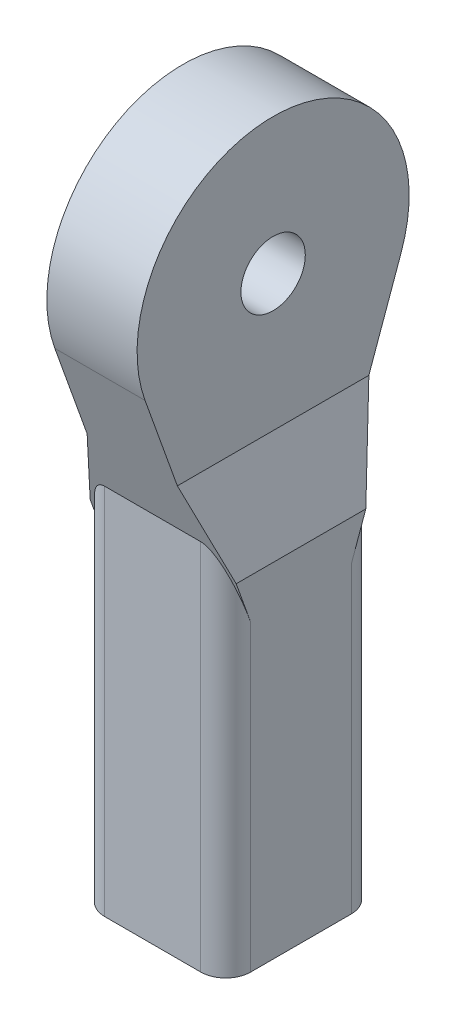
ISO-10303-21;
HEADER;
FILE_DESCRIPTION(('STEP AP214'),'2;1');
FILE_NAME('part.step','',(''),(''),'','','');
FILE_SCHEMA(('AUTOMOTIVE_DESIGN { 1 0 10303 214 1 1 1 1 }'));
ENDSEC;
DATA;
#1=APPLICATION_CONTEXT('core data for automotive mechanical design processes');
#2=APPLICATION_PROTOCOL_DEFINITION('international standard','automotive_design',2000,#1);
#3=PRODUCT_CONTEXT('',#1,'mechanical');
#4=PRODUCT('Part','Part','',(#3));
#5=PRODUCT_RELATED_PRODUCT_CATEGORY('part','',(#4));
#6=PRODUCT_DEFINITION_FORMATION('','',#4);
#7=PRODUCT_DEFINITION_CONTEXT('part definition',#1,'design');
#8=PRODUCT_DEFINITION('design','',#6,#7);
#9=PRODUCT_DEFINITION_SHAPE('','',#8);
#10=(LENGTH_UNIT() NAMED_UNIT(*) SI_UNIT(.MILLI.,.METRE.));
#11=(NAMED_UNIT(*) PLANE_ANGLE_UNIT() SI_UNIT($,.RADIAN.));
#12=(NAMED_UNIT(*) SI_UNIT($,.STERADIAN.) SOLID_ANGLE_UNIT());
#13=UNCERTAINTY_MEASURE_WITH_UNIT(LENGTH_MEASURE(1.E-05),#10,'distance_accuracy_value','');
#14=(GEOMETRIC_REPRESENTATION_CONTEXT(3) GLOBAL_UNCERTAINTY_ASSIGNED_CONTEXT((#13)) GLOBAL_UNIT_ASSIGNED_CONTEXT((#10,
#11,#12)) REPRESENTATION_CONTEXT('',''));
#15=CARTESIAN_POINT('',(0.,0.,0.));
#16=DIRECTION('',(0.,0.,1.));
#17=DIRECTION('',(1.,0.,0.));
#18=AXIS2_PLACEMENT_3D('',#15,#16,#17);
#19=CARTESIAN_POINT('',(4.0894,9.56309999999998,-0.867800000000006));
#20=DIRECTION('',(-1.,0.,0.));
#21=DIRECTION('',(0.,0.,1.));
#22=AXIS2_PLACEMENT_3D('',#19,#20,#21);
#23=CYLINDRICAL_SURFACE('',#22,3.81);
#24=DIRECTION('',(-1.,0.,0.));
#25=VECTOR('',#24,1.);
#26=CARTESIAN_POINT('',(4.0894,8.27758924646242,2.7187808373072));
#27=LINE('',#26,#25);
#28=CARTESIAN_POINT('',(3.30835,8.27758924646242,2.7187808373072));
#29=VERTEX_POINT('',#28);
#30=CARTESIAN_POINT('',(0.781049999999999,8.27758924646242,2.7187808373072));
#31=VERTEX_POINT('',#30);
#32=EDGE_CURVE('E200',#29,#31,#27,.T.);
#33=ORIENTED_EDGE('',*,*,#32,.F.);
#34=CARTESIAN_POINT('',(3.30835,9.56309999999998,-0.867800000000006));
#35=DIRECTION('',(-1.,0.,0.));
#36=DIRECTION('',(0.,-1.,0.));
#37=AXIS2_PLACEMENT_3D('',#34,#35,#36);
#38=CIRCLE('',#37,3.81);
#39=CARTESIAN_POINT('',(3.30835,8.27758924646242,-4.45438083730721));
#40=VERTEX_POINT('',#39);
#41=EDGE_CURVE('E287',#29,#40,#38,.T.);
#42=ORIENTED_EDGE('',*,*,#41,.T.);
#43=DIRECTION('',(-1.,0.,0.));
#44=VECTOR('',#43,1.);
#45=CARTESIAN_POINT('',(4.0894,8.27758924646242,-4.45438083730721));
#46=LINE('',#45,#44);
#47=CARTESIAN_POINT('',(0.781049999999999,8.27758924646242,-4.45438083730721));
#48=VERTEX_POINT('',#47);
#49=EDGE_CURVE('E203',#40,#48,#46,.T.);
#50=ORIENTED_EDGE('',*,*,#49,.T.);
#51=CARTESIAN_POINT('',(0.781049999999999,9.56309999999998,-0.867800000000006));
#52=DIRECTION('',(1.,0.,0.));
#53=DIRECTION('',(0.,1.,0.));
#54=AXIS2_PLACEMENT_3D('',#51,#52,#53);
#55=CIRCLE('',#54,3.81);
#56=EDGE_CURVE('E295',#48,#31,#55,.T.);
#57=ORIENTED_EDGE('',*,*,#56,.T.);
#58=EDGE_LOOP('',(#33,#42,#50,#57));
#59=FACE_BOUND('',#58,.T.);
#60=ADVANCED_FACE('F44',(#59),#23,.T.);
#61=CARTESIAN_POINT('',(4.0894,-6.28650000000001,-2.97600000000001));
#62=DIRECTION('',(0.,0.,1.));
#63=DIRECTION('',(1.,0.,0.));
#64=AXIS2_PLACEMENT_3D('',#61,#62,#63);
#65=PLANE('',#64);
#66=DIRECTION('',(-1.,0.,0.));
#67=VECTOR('',#66,1.);
#68=CARTESIAN_POINT('',(4.0894,-6.28650000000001,-2.97600000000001));
#69=LINE('',#68,#67);
#70=CARTESIAN_POINT('',(3.3894,-6.28650000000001,-2.97600000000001));
#71=VERTEX_POINT('',#70);
#72=CARTESIAN_POINT('',(0.7,-6.28650000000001,-2.97600000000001));
#73=VERTEX_POINT('',#72);
#74=EDGE_CURVE('E187',#71,#73,#69,.T.);
#75=ORIENTED_EDGE('',*,*,#74,.T.);
#76=DIRECTION('',(0.,1.,0.));
#77=VECTOR('',#76,1.);
#78=CARTESIAN_POINT('',(0.7,-6.28650000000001,-2.97600000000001));
#79=LINE('',#78,#77);
#80=CARTESIAN_POINT('',(0.7,4.15289999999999,-2.97600000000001));
#81=VERTEX_POINT('',#80);
#82=EDGE_CURVE('E238',#73,#81,#79,.T.);
#83=ORIENTED_EDGE('',*,*,#82,.T.);
#84=DIRECTION('',(-1.,0.,0.));
#85=VECTOR('',#84,1.);
#86=CARTESIAN_POINT('',(4.0894,4.15289999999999,-2.97600000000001));
#87=LINE('',#86,#85);
#88=CARTESIAN_POINT('',(3.3894,4.15289999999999,-2.97600000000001));
#89=VERTEX_POINT('',#88);
#90=EDGE_CURVE('E207',#89,#81,#87,.T.);
#91=ORIENTED_EDGE('',*,*,#90,.F.);
#92=DIRECTION('',(0.,1.,0.));
#93=VECTOR('',#92,1.);
#94=CARTESIAN_POINT('',(3.3894,-6.28650000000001,-2.97600000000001));
#95=LINE('',#94,#93);
#96=EDGE_CURVE('E235',#89,#71,#95,.F.);
#97=ORIENTED_EDGE('',*,*,#96,.T.);
#98=EDGE_LOOP('',(#75,#83,#91,#97));
#99=FACE_BOUND('',#98,.T.);
#100=ADVANCED_FACE('F334',(#99),#65,.F.);
#101=CARTESIAN_POINT('',(4.0894,4.15289999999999,-2.97600000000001));
#102=DIRECTION('',(0.,0.337404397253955,0.941359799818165));
#103=DIRECTION('',(0.,-0.941359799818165,0.337404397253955));
#104=AXIS2_PLACEMENT_3D('',#101,#102,#103);
#105=PLANE('',#104);
#106=DIRECTION('',(0.,-0.941359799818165,0.337404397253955));
#107=VECTOR('',#106,1.);
#108=CARTESIAN_POINT('',(3.30835,4.15289999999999,-2.97600000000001));
#109=LINE('',#108,#107);
#110=CARTESIAN_POINT('',(3.30835,5.75309999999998,-3.54954745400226));
#111=VERTEX_POINT('',#110);
#112=EDGE_CURVE('E280',#40,#111,#109,.T.);
#113=ORIENTED_EDGE('',*,*,#112,.T.);
#114=DIRECTION('',(0.291038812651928,-0.9006095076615,0.32279858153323));
#115=VECTOR('',#114,1.);
#116=CARTESIAN_POINT('',(3.8478228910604,4.08371985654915,-2.95120428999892));
#117=LINE('',#116,#115);
#118=CARTESIAN_POINT('',(4.0894,3.33616787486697,-2.68326494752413));
#119=VERTEX_POINT('',#118);
#120=EDGE_CURVE('E298',#111,#119,#117,.T.);
#121=ORIENTED_EDGE('',*,*,#120,.T.);
#122=DIRECTION('',(0.,0.941359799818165,-0.337404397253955));
#123=VECTOR('',#122,1.);
#124=CARTESIAN_POINT('',(4.0894,4.15289999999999,-2.97600000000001));
#125=LINE('',#124,#123);
#126=CARTESIAN_POINT('',(4.0894,2.19989682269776,-2.27600000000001));
#127=VERTEX_POINT('',#126);
#128=EDGE_CURVE('E181',#127,#119,#125,.T.);
#129=ORIENTED_EDGE('',*,*,#128,.F.);
#130=CARTESIAN_POINT('',(3.3894,2.19989682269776,-2.27600000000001));
#131=DIRECTION('',(0.,0.337404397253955,0.941359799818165));
#132=DIRECTION('',(0.,-0.941359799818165,0.337404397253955));
#133=AXIS2_PLACEMENT_3D('',#130,#131,#132);
#134=ELLIPSE('',#133,2.07466175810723,0.7);
#135=EDGE_CURVE('E257',#127,#89,#134,.T.);
#136=ORIENTED_EDGE('',*,*,#135,.T.);
#137=ORIENTED_EDGE('',*,*,#90,.T.);
#138=CARTESIAN_POINT('',(0.7,2.19989682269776,-2.27600000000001));
#139=DIRECTION('',(0.,0.337404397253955,0.941359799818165));
#140=DIRECTION('',(0.,0.941359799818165,-0.337404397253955));
#141=AXIS2_PLACEMENT_3D('',#138,#139,#140);
#142=ELLIPSE('',#141,2.07466175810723,0.7);
#143=CARTESIAN_POINT('',(0.,2.19989682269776,-2.27600000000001));
#144=VERTEX_POINT('',#143);
#145=EDGE_CURVE('E253',#81,#144,#142,.T.);
#146=ORIENTED_EDGE('',*,*,#145,.T.);
#147=DIRECTION('',(0.,0.941359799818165,-0.337404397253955));
#148=VECTOR('',#147,1.);
#149=CARTESIAN_POINT('',(0.,4.15289999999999,-2.97600000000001));
#150=LINE('',#149,#148);
#151=CARTESIAN_POINT('',(0.,3.33616787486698,-2.68326494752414));
#152=VERTEX_POINT('',#151);
#153=EDGE_CURVE('E176',#144,#152,#150,.T.);
#154=ORIENTED_EDGE('',*,*,#153,.T.);
#155=DIRECTION('',(0.291038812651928,0.9006095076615,-0.32279858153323));
#156=VECTOR('',#155,1.);
#157=CARTESIAN_POINT('',(0.587963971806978,5.15560198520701,-3.33539080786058));
#158=LINE('',#157,#156);
#159=CARTESIAN_POINT('',(0.781049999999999,5.75309999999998,-3.54954745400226));
#160=VERTEX_POINT('',#159);
#161=EDGE_CURVE('E69',#152,#160,#158,.T.);
#162=ORIENTED_EDGE('',*,*,#161,.T.);
#163=DIRECTION('',(0.,0.941359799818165,-0.337404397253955));
#164=VECTOR('',#163,1.);
#165=CARTESIAN_POINT('',(0.781049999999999,4.15289999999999,-2.97600000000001));
#166=LINE('',#165,#164);
#167=EDGE_CURVE('E291',#160,#48,#166,.T.);
#168=ORIENTED_EDGE('',*,*,#167,.T.);
#169=ORIENTED_EDGE('',*,*,#49,.F.);
#170=EDGE_LOOP('',(#113,#121,#129,#136,#137,#146,#154,#162,#168,#169));
#171=FACE_BOUND('',#170,.T.);
#172=ADVANCED_FACE('F342',(#171),#105,.F.);
#173=CARTESIAN_POINT('',(4.0894,4.15289999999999,1.2404));
#174=DIRECTION('',(0.,0.337404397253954,-0.941359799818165));
#175=DIRECTION('',(0.,0.941359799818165,0.337404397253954));
#176=AXIS2_PLACEMENT_3D('',#173,#174,#175);
#177=PLANE('',#176);
#178=DIRECTION('',(0.,-0.941359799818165,-0.337404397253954));
#179=VECTOR('',#178,1.);
#180=CARTESIAN_POINT('',(4.0894,4.15289999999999,1.2404));
#181=LINE('',#180,#179);
#182=CARTESIAN_POINT('',(4.0894,3.33616787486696,0.947664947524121));
#183=VERTEX_POINT('',#182);
#184=CARTESIAN_POINT('',(4.0894,2.19989682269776,0.540399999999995));
#185=VERTEX_POINT('',#184);
#186=EDGE_CURVE('E269',#183,#185,#181,.T.);
#187=ORIENTED_EDGE('',*,*,#186,.F.);
#188=DIRECTION('',(-0.291038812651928,0.9006095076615,0.32279858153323));
#189=VECTOR('',#188,1.);
#190=CARTESIAN_POINT('',(3.8478228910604,4.08371985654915,1.21560428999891));
#191=LINE('',#190,#189);
#192=CARTESIAN_POINT('',(3.30835,5.75309999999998,1.81394745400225));
#193=VERTEX_POINT('',#192);
#194=EDGE_CURVE('E61',#183,#193,#191,.T.);
#195=ORIENTED_EDGE('',*,*,#194,.T.);
#196=DIRECTION('',(0.,0.941359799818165,0.337404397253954));
#197=VECTOR('',#196,1.);
#198=CARTESIAN_POINT('',(3.30835,4.15289999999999,1.2404));
#199=LINE('',#198,#197);
#200=EDGE_CURVE('E11',#193,#29,#199,.T.);
#201=ORIENTED_EDGE('',*,*,#200,.T.);
#202=ORIENTED_EDGE('',*,*,#32,.T.);
#203=DIRECTION('',(0.,-0.941359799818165,-0.337404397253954));
#204=VECTOR('',#203,1.);
#205=CARTESIAN_POINT('',(0.781049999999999,4.15289999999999,1.24039999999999));
#206=LINE('',#205,#204);
#207=CARTESIAN_POINT('',(0.78105,5.75309999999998,1.81394745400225));
#208=VERTEX_POINT('',#207);
#209=EDGE_CURVE('E54',#31,#208,#206,.T.);
#210=ORIENTED_EDGE('',*,*,#209,.T.);
#211=DIRECTION('',(-0.291038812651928,-0.900609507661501,-0.32279858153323));
#212=VECTOR('',#211,1.);
#213=CARTESIAN_POINT('',(0.587963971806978,5.15560198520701,1.59979080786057));
#214=LINE('',#213,#212);
#215=CARTESIAN_POINT('',(0.,3.33616787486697,0.947664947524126));
#216=VERTEX_POINT('',#215);
#217=EDGE_CURVE('E149',#208,#216,#214,.T.);
#218=ORIENTED_EDGE('',*,*,#217,.T.);
#219=DIRECTION('',(0.,-0.941359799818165,-0.337404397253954));
#220=VECTOR('',#219,1.);
#221=CARTESIAN_POINT('',(0.,4.15289999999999,1.2404));
#222=LINE('',#221,#220);
#223=CARTESIAN_POINT('',(0.,2.19989682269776,0.540399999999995));
#224=VERTEX_POINT('',#223);
#225=EDGE_CURVE('E162',#216,#224,#222,.T.);
#226=ORIENTED_EDGE('',*,*,#225,.T.);
#227=CARTESIAN_POINT('',(0.7,2.19989682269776,0.540399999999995));
#228=DIRECTION('',(0.,0.337404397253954,-0.941359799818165));
#229=DIRECTION('',(0.,-0.941359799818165,-0.337404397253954));
#230=AXIS2_PLACEMENT_3D('',#227,#228,#229);
#231=ELLIPSE('',#230,2.07466175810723,0.7);
#232=CARTESIAN_POINT('',(0.7,4.15289999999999,1.2404));
#233=VERTEX_POINT('',#232);
#234=EDGE_CURVE('E250',#224,#233,#231,.T.);
#235=ORIENTED_EDGE('',*,*,#234,.T.);
#236=DIRECTION('',(-1.,0.,0.));
#237=VECTOR('',#236,1.);
#238=CARTESIAN_POINT('',(4.0894,4.15289999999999,1.2404));
#239=LINE('',#238,#237);
#240=CARTESIAN_POINT('',(3.3894,4.15289999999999,1.2404));
#241=VERTEX_POINT('',#240);
#242=EDGE_CURVE('E196',#241,#233,#239,.T.);
#243=ORIENTED_EDGE('',*,*,#242,.F.);
#244=CARTESIAN_POINT('',(3.3894,2.19989682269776,0.540399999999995));
#245=DIRECTION('',(0.,0.337404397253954,-0.941359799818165));
#246=DIRECTION('',(0.,0.941359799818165,0.337404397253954));
#247=AXIS2_PLACEMENT_3D('',#244,#245,#246);
#248=ELLIPSE('',#247,2.07466175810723,0.7);
#249=EDGE_CURVE('E156',#241,#185,#248,.T.);
#250=ORIENTED_EDGE('',*,*,#249,.T.);
#251=EDGE_LOOP('',(#187,#195,#201,#202,#210,#218,#226,#235,#243,#250));
#252=FACE_BOUND('',#251,.T.);
#253=ADVANCED_FACE('F161',(#252),#177,.F.);
#254=CARTESIAN_POINT('',(4.0894,-6.28650000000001,1.24039999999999));
#255=DIRECTION('',(0.,0.,-1.));
#256=DIRECTION('',(0.,1.,0.));
#257=AXIS2_PLACEMENT_3D('',#254,#255,#256);
#258=PLANE('',#257);
#259=ORIENTED_EDGE('',*,*,#242,.T.);
#260=DIRECTION('',(0.,-1.,0.));
#261=VECTOR('',#260,1.);
#262=CARTESIAN_POINT('',(0.7,-6.28650000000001,1.24039999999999));
#263=LINE('',#262,#261);
#264=CARTESIAN_POINT('',(0.7,-6.28650000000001,1.24039999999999));
#265=VERTEX_POINT('',#264);
#266=EDGE_CURVE('E214',#233,#265,#263,.T.);
#267=ORIENTED_EDGE('',*,*,#266,.T.);
#268=DIRECTION('',(-1.,0.,0.));
#269=VECTOR('',#268,1.);
#270=CARTESIAN_POINT('',(4.0894,-6.28650000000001,1.24039999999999));
#271=LINE('',#270,#269);
#272=CARTESIAN_POINT('',(3.3894,-6.28650000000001,1.24039999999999));
#273=VERTEX_POINT('',#272);
#274=EDGE_CURVE('E191',#273,#265,#271,.T.);
#275=ORIENTED_EDGE('',*,*,#274,.F.);
#276=DIRECTION('',(0.,-1.,0.));
#277=VECTOR('',#276,1.);
#278=CARTESIAN_POINT('',(3.3894,4.15289999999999,1.2404));
#279=LINE('',#278,#277);
#280=EDGE_CURVE('E211',#273,#241,#279,.F.);
#281=ORIENTED_EDGE('',*,*,#280,.T.);
#282=EDGE_LOOP('',(#259,#267,#275,#281));
#283=FACE_BOUND('',#282,.T.);
#284=ADVANCED_FACE('F380',(#283),#258,.F.);
#285=CARTESIAN_POINT('',(4.0894,-6.28650000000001,1.24039999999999));
#286=DIRECTION('',(0.,1.,0.));
#287=DIRECTION('',(0.,0.,1.));
#288=AXIS2_PLACEMENT_3D('',#285,#286,#287);
#289=PLANE('',#288);
#290=CARTESIAN_POINT('',(2.0447,-6.28650000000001,-0.867800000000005));
#291=DIRECTION('',(0.,-1.,0.));
#292=DIRECTION('',(0.,0.,-1.));
#293=AXIS2_PLACEMENT_3D('',#290,#291,#292);
#294=CIRCLE('',#293,0.900000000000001);
#295=CARTESIAN_POINT('',(2.0447,-6.28650000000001,-1.76780000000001));
#296=VERTEX_POINT('',#295);
#297=EDGE_CURVE('E276',#296,#296,#294,.T.);
#298=ORIENTED_EDGE('',*,*,#297,.F.);
#299=EDGE_LOOP('',(#298));
#300=FACE_BOUND('',#299,.T.);
#301=ORIENTED_EDGE('',*,*,#274,.T.);
#302=CARTESIAN_POINT('',(0.7,-6.28650000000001,0.540399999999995));
#303=DIRECTION('',(0.,1.,0.));
#304=DIRECTION('',(0.,0.,1.));
#305=AXIS2_PLACEMENT_3D('',#302,#303,#304);
#306=CIRCLE('',#305,0.7);
#307=CARTESIAN_POINT('',(0.,-6.28650000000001,0.540399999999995));
#308=VERTEX_POINT('',#307);
#309=EDGE_CURVE('E227',#265,#308,#306,.F.);
#310=ORIENTED_EDGE('',*,*,#309,.T.);
#311=DIRECTION('',(0.,0.,-1.));
#312=VECTOR('',#311,1.);
#313=CARTESIAN_POINT('',(0.,-6.28650000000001,1.24039999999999));
#314=LINE('',#313,#312);
#315=CARTESIAN_POINT('',(0.,-6.28650000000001,-2.27600000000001));
#316=VERTEX_POINT('',#315);
#317=EDGE_CURVE('E175',#308,#316,#314,.T.);
#318=ORIENTED_EDGE('',*,*,#317,.T.);
#319=CARTESIAN_POINT('',(0.7,-6.28650000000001,-2.27600000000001));
#320=DIRECTION('',(0.,1.,0.));
#321=DIRECTION('',(0.,0.,1.));
#322=AXIS2_PLACEMENT_3D('',#319,#320,#321);
#323=CIRCLE('',#322,0.7);
#324=EDGE_CURVE('E224',#316,#73,#323,.F.);
#325=ORIENTED_EDGE('',*,*,#324,.T.);
#326=ORIENTED_EDGE('',*,*,#74,.F.);
#327=CARTESIAN_POINT('',(3.3894,-6.28650000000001,-2.27600000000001));
#328=DIRECTION('',(0.,1.,0.));
#329=DIRECTION('',(0.,0.,1.));
#330=AXIS2_PLACEMENT_3D('',#327,#328,#329);
#331=CIRCLE('',#330,0.7);
#332=CARTESIAN_POINT('',(4.0894,-6.28650000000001,-2.27600000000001));
#333=VERTEX_POINT('',#332);
#334=EDGE_CURVE('E221',#71,#333,#331,.F.);
#335=ORIENTED_EDGE('',*,*,#334,.T.);
#336=DIRECTION('',(0.,0.,-1.));
#337=VECTOR('',#336,1.);
#338=CARTESIAN_POINT('',(4.0894,-6.28650000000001,1.24039999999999));
#339=LINE('',#338,#337);
#340=CARTESIAN_POINT('',(4.0894,-6.28650000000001,0.540399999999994));
#341=VERTEX_POINT('',#340);
#342=EDGE_CURVE('E192',#341,#333,#339,.T.);
#343=ORIENTED_EDGE('',*,*,#342,.F.);
#344=CARTESIAN_POINT('',(3.3894,-6.28650000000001,0.540399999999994));
#345=DIRECTION('',(0.,1.,0.));
#346=DIRECTION('',(0.,0.,1.));
#347=AXIS2_PLACEMENT_3D('',#344,#345,#346);
#348=CIRCLE('',#347,0.7);
#349=EDGE_CURVE('E218',#341,#273,#348,.F.);
#350=ORIENTED_EDGE('',*,*,#349,.T.);
#351=EDGE_LOOP('',(#301,#310,#318,#325,#326,#335,#343,#350));
#352=FACE_BOUND('',#351,.T.);
#353=ADVANCED_FACE('F373',(#300,#352),#289,.F.);
#354=CARTESIAN_POINT('',(4.0894,9.56309999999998,-0.867800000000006));
#355=DIRECTION('',(1.,0.,0.));
#356=DIRECTION('',(0.,0.,-1.));
#357=AXIS2_PLACEMENT_3D('',#354,#355,#356);
#358=PLANE('',#357);
#359=DIRECTION('',(0.,0.,-1.));
#360=VECTOR('',#359,1.);
#361=CARTESIAN_POINT('',(4.0894,3.33616787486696,-0.867800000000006));
#362=LINE('',#361,#360);
#363=EDGE_CURVE('E155',#183,#119,#362,.T.);
#364=ORIENTED_EDGE('',*,*,#363,.F.);
#365=ORIENTED_EDGE('',*,*,#186,.T.);
#366=DIRECTION('',(0.,-1.,0.));
#367=VECTOR('',#366,1.);
#368=CARTESIAN_POINT('',(4.0894,-6.28650000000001,0.540399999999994));
#369=LINE('',#368,#367);
#370=EDGE_CURVE('E242',#185,#341,#369,.T.);
#371=ORIENTED_EDGE('',*,*,#370,.T.);
#372=ORIENTED_EDGE('',*,*,#342,.T.);
#373=DIRECTION('',(0.,1.,0.));
#374=VECTOR('',#373,1.);
#375=CARTESIAN_POINT('',(4.0894,4.15289999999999,-2.27600000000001));
#376=LINE('',#375,#374);
#377=EDGE_CURVE('E246',#333,#127,#376,.T.);
#378=ORIENTED_EDGE('',*,*,#377,.T.);
#379=ORIENTED_EDGE('',*,*,#128,.T.);
#380=EDGE_LOOP('',(#364,#365,#371,#372,#378,#379));
#381=FACE_BOUND('',#380,.T.);
#382=ADVANCED_FACE('F374',(#381),#358,.T.);
#383=CARTESIAN_POINT('',(0.,9.56309999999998,-0.867800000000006));
#384=DIRECTION('',(1.,0.,0.));
#385=DIRECTION('',(0.,0.,-1.));
#386=AXIS2_PLACEMENT_3D('',#383,#384,#385);
#387=PLANE('',#386);
#388=ORIENTED_EDGE('',*,*,#225,.F.);
#389=DIRECTION('',(0.,0.,-1.));
#390=VECTOR('',#389,1.);
#391=CARTESIAN_POINT('',(0.,3.33616787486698,-0.867800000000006));
#392=LINE('',#391,#390);
#393=EDGE_CURVE('E146',#216,#152,#392,.T.);
#394=ORIENTED_EDGE('',*,*,#393,.T.);
#395=ORIENTED_EDGE('',*,*,#153,.F.);
#396=DIRECTION('',(0.,1.,0.));
#397=VECTOR('',#396,1.);
#398=CARTESIAN_POINT('',(0.,9.56309999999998,-2.27600000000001));
#399=LINE('',#398,#397);
#400=EDGE_CURVE('E230',#144,#316,#399,.F.);
#401=ORIENTED_EDGE('',*,*,#400,.T.);
#402=ORIENTED_EDGE('',*,*,#317,.F.);
#403=DIRECTION('',(0.,-1.,0.));
#404=VECTOR('',#403,1.);
#405=CARTESIAN_POINT('',(0.,9.56309999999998,0.540399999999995));
#406=LINE('',#405,#404);
#407=EDGE_CURVE('E172',#308,#224,#406,.F.);
#408=ORIENTED_EDGE('',*,*,#407,.T.);
#409=EDGE_LOOP('',(#388,#394,#395,#401,#402,#408));
#410=FACE_BOUND('',#409,.T.);
#411=ADVANCED_FACE('F169',(#410),#387,.F.);
#412=CARTESIAN_POINT('',(2.0447,-3.74650000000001,-0.867800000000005));
#413=DIRECTION('',(0.,-1.,0.));
#414=DIRECTION('',(0.,0.,-1.));
#415=AXIS2_PLACEMENT_3D('',#412,#413,#414);
#416=CYLINDRICAL_SURFACE('',#415,0.900000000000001);
#417=CARTESIAN_POINT('',(2.0447,-3.74650000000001,-0.867800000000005));
#418=DIRECTION('',(0.,-1.,0.));
#419=DIRECTION('',(0.,0.,-1.));
#420=AXIS2_PLACEMENT_3D('',#417,#418,#419);
#421=CIRCLE('',#420,0.900000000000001);
#422=CARTESIAN_POINT('',(2.0447,-3.74650000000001,-1.76780000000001));
#423=VERTEX_POINT('',#422);
#424=EDGE_CURVE('E183',#423,#423,#421,.T.);
#425=ORIENTED_EDGE('',*,*,#424,.F.);
#426=EDGE_LOOP('',(#425));
#427=FACE_BOUND('',#426,.T.);
#428=ORIENTED_EDGE('',*,*,#297,.T.);
#429=EDGE_LOOP('',(#428));
#430=FACE_BOUND('',#429,.T.);
#431=ADVANCED_FACE('F400',(#427,#430),#416,.F.);
#432=CARTESIAN_POINT('',(2.0447,-3.74650000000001,-0.867800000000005));
#433=DIRECTION('',(0.,-1.,0.));
#434=DIRECTION('',(0.,0.,-1.));
#435=AXIS2_PLACEMENT_3D('',#432,#433,#434);
#436=PLANE('',#435);
#437=ORIENTED_EDGE('',*,*,#424,.T.);
#438=EDGE_LOOP('',(#437));
#439=FACE_BOUND('',#438,.T.);
#440=ADVANCED_FACE('F355',(#439),#436,.T.);
#441=CARTESIAN_POINT('',(0.7,-6.28650000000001,0.540399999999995));
#442=DIRECTION('',(0.,-1.,0.));
#443=DIRECTION('',(0.,0.,-1.));
#444=AXIS2_PLACEMENT_3D('',#441,#442,#443);
#445=CYLINDRICAL_SURFACE('',#444,0.7);
#446=ORIENTED_EDGE('',*,*,#234,.F.);
#447=ORIENTED_EDGE('',*,*,#407,.F.);
#448=ORIENTED_EDGE('',*,*,#309,.F.);
#449=ORIENTED_EDGE('',*,*,#266,.F.);
#450=EDGE_LOOP('',(#446,#447,#448,#449));
#451=FACE_BOUND('',#450,.T.);
#452=ADVANCED_FACE('F351',(#451),#445,.T.);
#453=CARTESIAN_POINT('',(0.7,-6.28650000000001,-2.27600000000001));
#454=DIRECTION('',(0.,1.,0.));
#455=DIRECTION('',(0.,0.,1.));
#456=AXIS2_PLACEMENT_3D('',#453,#454,#455);
#457=CYLINDRICAL_SURFACE('',#456,0.7);
#458=ORIENTED_EDGE('',*,*,#324,.F.);
#459=ORIENTED_EDGE('',*,*,#400,.F.);
#460=ORIENTED_EDGE('',*,*,#145,.F.);
#461=ORIENTED_EDGE('',*,*,#82,.F.);
#462=EDGE_LOOP('',(#458,#459,#460,#461));
#463=FACE_BOUND('',#462,.T.);
#464=ADVANCED_FACE('F354',(#463),#457,.T.);
#465=CARTESIAN_POINT('',(3.3894,9.56309999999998,-2.27600000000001));
#466=DIRECTION('',(0.,-1.,0.));
#467=DIRECTION('',(0.,0.,-1.));
#468=AXIS2_PLACEMENT_3D('',#465,#466,#467);
#469=CYLINDRICAL_SURFACE('',#468,0.7);
#470=ORIENTED_EDGE('',*,*,#334,.F.);
#471=ORIENTED_EDGE('',*,*,#96,.F.);
#472=ORIENTED_EDGE('',*,*,#135,.F.);
#473=ORIENTED_EDGE('',*,*,#377,.F.);
#474=EDGE_LOOP('',(#470,#471,#472,#473));
#475=FACE_BOUND('',#474,.T.);
#476=ADVANCED_FACE('F358',(#475),#469,.T.);
#477=CARTESIAN_POINT('',(3.3894,9.56309999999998,0.540399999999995));
#478=DIRECTION('',(0.,1.,0.));
#479=DIRECTION('',(0.,0.,1.));
#480=AXIS2_PLACEMENT_3D('',#477,#478,#479);
#481=CYLINDRICAL_SURFACE('',#480,0.7);
#482=ORIENTED_EDGE('',*,*,#249,.F.);
#483=ORIENTED_EDGE('',*,*,#280,.F.);
#484=ORIENTED_EDGE('',*,*,#349,.F.);
#485=ORIENTED_EDGE('',*,*,#370,.F.);
#486=EDGE_LOOP('',(#482,#483,#484,#485));
#487=FACE_BOUND('',#486,.T.);
#488=ADVANCED_FACE('F46',(#487),#481,.T.);
#489=CARTESIAN_POINT('',(0.781049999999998,13.3731,-4.6778));
#490=DIRECTION('',(1.,0.,0.));
#491=DIRECTION('',(0.,1.,0.));
#492=AXIS2_PLACEMENT_3D('',#489,#490,#491);
#493=PLANE('',#492);
#494=CARTESIAN_POINT('',(0.781049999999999,9.56309999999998,-0.867800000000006));
#495=DIRECTION('',(1.,0.,0.));
#496=DIRECTION('',(0.,1.,0.));
#497=AXIS2_PLACEMENT_3D('',#494,#495,#496);
#498=CIRCLE('',#497,0.9017);
#499=CARTESIAN_POINT('',(0.781049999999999,10.4648,-0.867800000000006));
#500=VERTEX_POINT('',#499);
#501=EDGE_CURVE('E309',#500,#500,#498,.T.);
#502=ORIENTED_EDGE('',*,*,#501,.T.);
#503=EDGE_LOOP('',(#502));
#504=FACE_BOUND('',#503,.T.);
#505=DIRECTION('',(0.,0.,1.));
#506=VECTOR('',#505,1.);
#507=CARTESIAN_POINT('',(0.781049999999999,5.75309999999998,-4.6778));
#508=LINE('',#507,#506);
#509=EDGE_CURVE('E306',#160,#208,#508,.T.);
#510=ORIENTED_EDGE('',*,*,#509,.T.);
#511=ORIENTED_EDGE('',*,*,#209,.F.);
#512=ORIENTED_EDGE('',*,*,#56,.F.);
#513=ORIENTED_EDGE('',*,*,#167,.F.);
#514=EDGE_LOOP('',(#510,#511,#512,#513));
#515=FACE_BOUND('',#514,.T.);
#516=ADVANCED_FACE('F364',(#504,#515),#493,.F.);
#517=CARTESIAN_POINT('',(0.781049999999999,5.75309999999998,-4.6778));
#518=DIRECTION('',(0.95154808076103,-0.307499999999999,0.));
#519=DIRECTION('',(0.307499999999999,0.951548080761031,0.));
#520=AXIS2_PLACEMENT_3D('',#517,#518,#519);
#521=PLANE('',#520);
#522=ORIENTED_EDGE('',*,*,#393,.F.);
#523=ORIENTED_EDGE('',*,*,#217,.F.);
#524=ORIENTED_EDGE('',*,*,#509,.F.);
#525=ORIENTED_EDGE('',*,*,#161,.F.);
#526=EDGE_LOOP('',(#522,#523,#524,#525));
#527=FACE_BOUND('',#526,.T.);
#528=ADVANCED_FACE('F148',(#527),#521,.F.);
#529=CARTESIAN_POINT('',(3.30835,13.3731,-4.6778));
#530=DIRECTION('',(-1.,0.,0.));
#531=DIRECTION('',(0.,-1.,0.));
#532=AXIS2_PLACEMENT_3D('',#529,#530,#531);
#533=PLANE('',#532);
#534=CARTESIAN_POINT('',(3.30835,9.56309999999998,-0.867800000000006));
#535=DIRECTION('',(-1.,0.,0.));
#536=DIRECTION('',(0.,-1.,0.));
#537=AXIS2_PLACEMENT_3D('',#534,#535,#536);
#538=CIRCLE('',#537,0.9017);
#539=CARTESIAN_POINT('',(3.30835,8.66139999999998,-0.867800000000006));
#540=VERTEX_POINT('',#539);
#541=EDGE_CURVE('E48',#540,#540,#538,.T.);
#542=ORIENTED_EDGE('',*,*,#541,.T.);
#543=EDGE_LOOP('',(#542));
#544=FACE_BOUND('',#543,.T.);
#545=ORIENTED_EDGE('',*,*,#41,.F.);
#546=ORIENTED_EDGE('',*,*,#200,.F.);
#547=DIRECTION('',(0.,0.,1.));
#548=VECTOR('',#547,1.);
#549=CARTESIAN_POINT('',(3.30835,5.75309999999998,-4.6778));
#550=LINE('',#549,#548);
#551=EDGE_CURVE('E167',#111,#193,#550,.T.);
#552=ORIENTED_EDGE('',*,*,#551,.F.);
#553=ORIENTED_EDGE('',*,*,#112,.F.);
#554=EDGE_LOOP('',(#545,#546,#552,#553));
#555=FACE_BOUND('',#554,.T.);
#556=ADVANCED_FACE('F320',(#544,#555),#533,.F.);
#557=CARTESIAN_POINT('',(3.30835,5.75309999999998,-4.6778));
#558=DIRECTION('',(-0.95154808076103,-0.3075,0.));
#559=DIRECTION('',(0.3075,-0.95154808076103,0.));
#560=AXIS2_PLACEMENT_3D('',#557,#558,#559);
#561=PLANE('',#560);
#562=ORIENTED_EDGE('',*,*,#551,.T.);
#563=ORIENTED_EDGE('',*,*,#194,.F.);
#564=ORIENTED_EDGE('',*,*,#363,.T.);
#565=ORIENTED_EDGE('',*,*,#120,.F.);
#566=EDGE_LOOP('',(#562,#563,#564,#565));
#567=FACE_BOUND('',#566,.T.);
#568=ADVANCED_FACE('F326',(#567),#561,.F.);
#569=CARTESIAN_POINT('',(0.,9.56309999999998,-0.867800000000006));
#570=DIRECTION('',(1.,0.,0.));
#571=DIRECTION('',(0.,1.,0.));
#572=AXIS2_PLACEMENT_3D('',#569,#570,#571);
#573=CYLINDRICAL_SURFACE('',#572,0.9017);
#574=ORIENTED_EDGE('',*,*,#541,.F.);
#575=EDGE_LOOP('',(#574));
#576=FACE_BOUND('',#575,.T.);
#577=ORIENTED_EDGE('',*,*,#501,.F.);
#578=EDGE_LOOP('',(#577));
#579=FACE_BOUND('',#578,.T.);
#580=ADVANCED_FACE('F323',(#576,#579),#573,.F.);
#581=CLOSED_SHELL('',(#60,#100,#172,#253,#284,#353,#382,#411,#431,#440,#452,#464,#476,#488,#516,
#528,#556,#568,#580));
#582=MANIFOLD_SOLID_BREP('B2',#581);
#583=ADVANCED_BREP_SHAPE_REPRESENTATION('',(#18,#582),#14);
#584=SHAPE_DEFINITION_REPRESENTATION(#9,#583);
ENDSEC;
END-ISO-10303-21;
